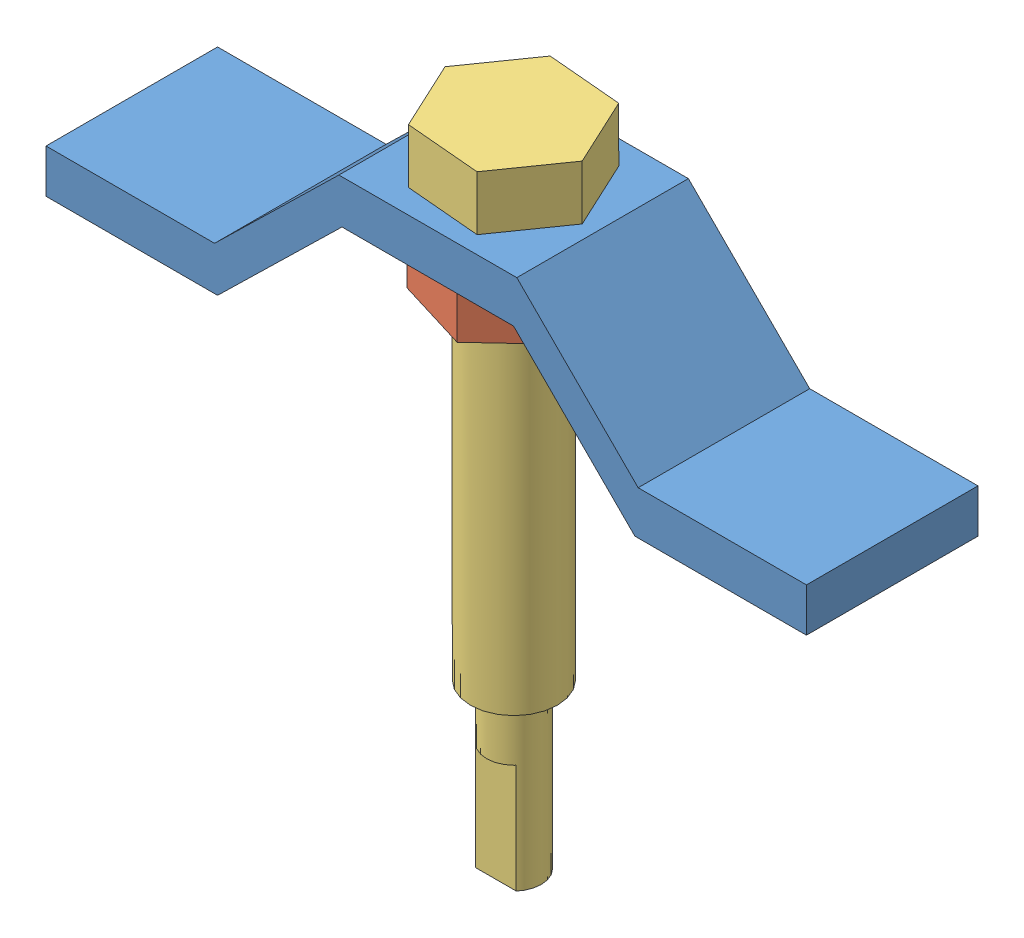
SolidWorks assembly Bracket4.SLDASM, configuration Default (file format 6000). Lengths in mm.
Overall size (88.65 76.21 20).
3 component instances, 3 part files, 2 mates.
Components (placement in the parent):
- Bracket-1: Bracket.SLDPRT [Default] at (51.9842 89.971 66.7203) size (88.65 19.23 20)
- nut3-1: nut3.SLDPRT [Default] at (11.0266 55.3171 76.7203) x (1 0.000622 0) z (0.000622 -1 0) size (16.83 17.15 6.35)
- NewBolt2-1: NewBolt2.SLDPRT [Default] at (11.0235 60.394 76.7203) x (1 0.000622 -0.000622) z (0.000622 -1 0) size (17.53 15.96 76.2)
Mates (geometry in assembly coordinates):
- Coincident1: coincident anti-aligned: plane of Bracket-1 through (0.6519 60.3875 86.7203) normal (-0.000622 1 0); plane of NewBolt2-1 through (11.0235 60.394 76.7203) normal (0.000622 -1 0)
- Concentric2: concentric aligned: cylinder of Bracket-1 through (11.0266 55.314 76.7203) axis (-0.000622 1 0) radius 5.08; cylinder of NewBolt2-1 through (11.0551 9.594 76.7203) axis (-0.000622 1 0) radius 5.08
